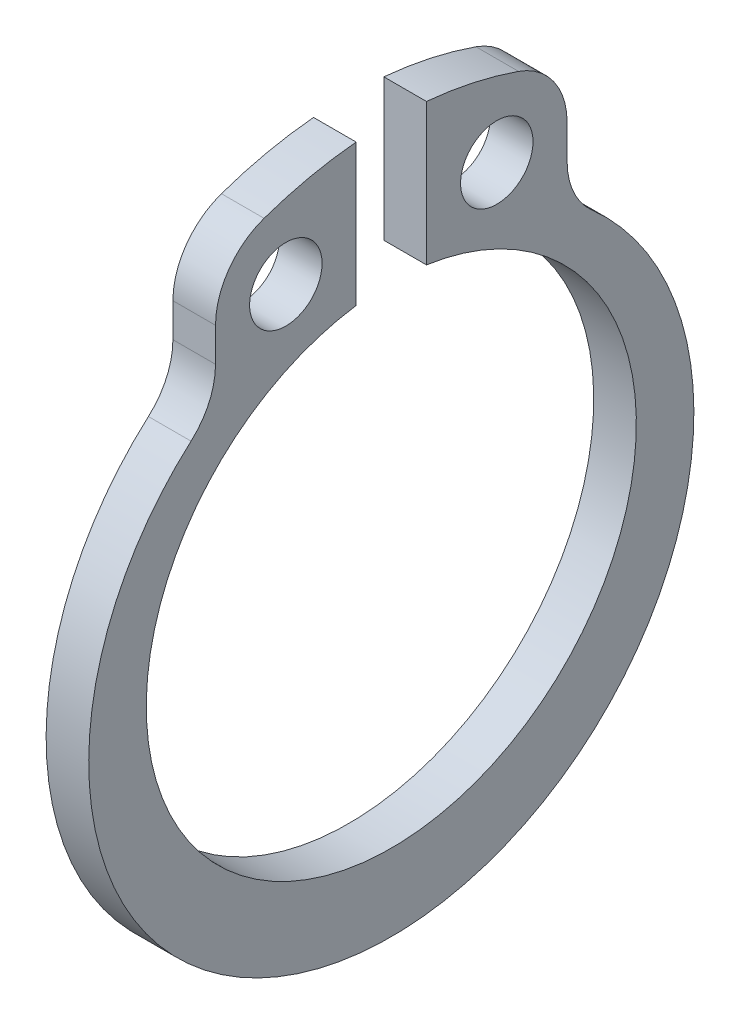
from build123d import *

# Parameters (mm, degrees)
ESQUISSE1_R      = 0.85
EXTRUSION1_DEPTH = 1


with BuildPart() as part:
    # Esquisse1 → Extrusion1 (new body)
    with BuildSketch(Plane(origin=(0, 0, 0), x_dir=(0, 0, -1), z_dir=(1, 0, 0))):
        with BuildLine():
            Line((4.125, 6.146163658), (4.125, 6.938434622))
            ThreePointArc((4.125, 6.938434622), (3.811272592, 7.922430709), (2.985884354, 8.543242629))
            ThreePointArc((2.985884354, 8.543242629), (1.919822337, 8.844025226), (0.825, 9.012317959))
            Line((0.825, 9.012317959), (0.825, 5.690507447))
            ThreePointArc((0.825, 5.690507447), (0, -5.75), (-0.825, 5.690507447))
            Line((-0.825, 5.690507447), (-0.825, 9.012317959))
            ThreePointArc((-0.825, 9.012317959), (-1.919822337, 8.844025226), (-2.985884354, 8.543242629))
            ThreePointArc((-2.985884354, 8.543242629), (-3.811272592, 7.922430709), (-4.125, 6.938434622))
            Line((-4.125, 6.938434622), (-4.125, 6.146163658))
            ThreePointArc((-4.125, 6.146163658), (-4.275325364, 5.447229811), (-4.699715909, 4.871904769))
            ThreePointArc((-4.699715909, 4.871904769), (0, -7.55), (4.699715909, 4.871904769))
            ThreePointArc((4.699715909, 4.871904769), (4.275325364, 5.447229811), (4.125, 6.146163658))
        make_face()
        with Locations((2.475, 6.947533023)):
            Circle(ESQUISSE1_R, mode=Mode.SUBTRACT)
        with Locations((-2.475, 6.947533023)):
            Circle(ESQUISSE1_R, mode=Mode.SUBTRACT)
    extrude(amount=EXTRUSION1_DEPTH)


solid = part.part
